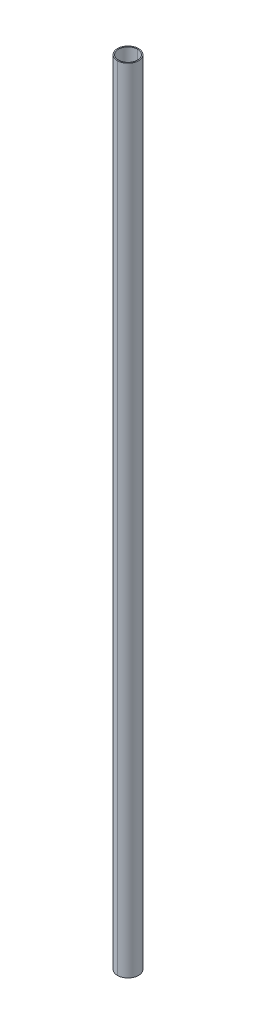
ISO-10303-21;
HEADER;
FILE_DESCRIPTION(('STEP AP214'),'2;1');
FILE_NAME('part.step','',(''),(''),'','','');
FILE_SCHEMA(('AUTOMOTIVE_DESIGN { 1 0 10303 214 1 1 1 1 }'));
ENDSEC;
DATA;
#1=APPLICATION_CONTEXT('core data for automotive mechanical design processes');
#2=APPLICATION_PROTOCOL_DEFINITION('international standard','automotive_design',2000,#1);
#3=PRODUCT_CONTEXT('',#1,'mechanical');
#4=PRODUCT('Part','Part','',(#3));
#5=PRODUCT_RELATED_PRODUCT_CATEGORY('part','',(#4));
#6=PRODUCT_DEFINITION_FORMATION('','',#4);
#7=PRODUCT_DEFINITION_CONTEXT('part definition',#1,'design');
#8=PRODUCT_DEFINITION('design','',#6,#7);
#9=PRODUCT_DEFINITION_SHAPE('','',#8);
#10=(LENGTH_UNIT() NAMED_UNIT(*) SI_UNIT(.MILLI.,.METRE.));
#11=(NAMED_UNIT(*) PLANE_ANGLE_UNIT() SI_UNIT($,.RADIAN.));
#12=(NAMED_UNIT(*) SI_UNIT($,.STERADIAN.) SOLID_ANGLE_UNIT());
#13=UNCERTAINTY_MEASURE_WITH_UNIT(LENGTH_MEASURE(1.E-05),#10,'distance_accuracy_value','');
#14=(GEOMETRIC_REPRESENTATION_CONTEXT(3) GLOBAL_UNCERTAINTY_ASSIGNED_CONTEXT((#13)) GLOBAL_UNIT_ASSIGNED_CONTEXT((#10,
#11,#12)) REPRESENTATION_CONTEXT('',''));
#15=CARTESIAN_POINT('',(0.,0.,0.));
#16=DIRECTION('',(0.,0.,1.));
#17=DIRECTION('',(1.,0.,0.));
#18=AXIS2_PLACEMENT_3D('',#15,#16,#17);
#19=CARTESIAN_POINT('',(0.,1500.,0.));
#20=DIRECTION('',(0.,-1.,0.));
#21=DIRECTION('',(0.,0.,-1.));
#22=AXIS2_PLACEMENT_3D('',#19,#20,#21);
#23=CYLINDRICAL_SURFACE('',#22,18.);
#24=DIRECTION('',(0.,-1.,0.));
#25=VECTOR('',#24,1.);
#26=CARTESIAN_POINT('',(0.,1500.,18.));
#27=LINE('',#26,#25);
#28=CARTESIAN_POINT('',(0.,1500.,18.));
#29=VERTEX_POINT('',#28);
#30=CARTESIAN_POINT('',(0.,0.,18.));
#31=VERTEX_POINT('',#30);
#32=EDGE_CURVE('E143',#29,#31,#27,.T.);
#33=ORIENTED_EDGE('',*,*,#32,.F.);
#34=CARTESIAN_POINT('',(0.,1500.,0.));
#35=DIRECTION('',(0.,1.,0.));
#36=DIRECTION('',(0.,0.,1.));
#37=AXIS2_PLACEMENT_3D('',#34,#35,#36);
#38=CIRCLE('',#37,18.);
#39=CARTESIAN_POINT('',(0.,1500.,-18.));
#40=VERTEX_POINT('',#39);
#41=EDGE_CURVE('E75',#29,#40,#38,.T.);
#42=ORIENTED_EDGE('',*,*,#41,.T.);
#43=DIRECTION('',(0.,-1.,0.));
#44=VECTOR('',#43,1.);
#45=CARTESIAN_POINT('',(0.,1500.,-18.));
#46=LINE('',#45,#44);
#47=CARTESIAN_POINT('',(0.,0.,-18.));
#48=VERTEX_POINT('',#47);
#49=EDGE_CURVE('E88',#40,#48,#46,.T.);
#50=ORIENTED_EDGE('',*,*,#49,.T.);
#51=CARTESIAN_POINT('',(0.,0.,0.));
#52=DIRECTION('',(0.,1.,0.));
#53=DIRECTION('',(0.,0.,1.));
#54=AXIS2_PLACEMENT_3D('',#51,#52,#53);
#55=CIRCLE('',#54,18.);
#56=EDGE_CURVE('E10',#31,#48,#55,.T.);
#57=ORIENTED_EDGE('',*,*,#56,.F.);
#58=EDGE_LOOP('',(#33,#42,#50,#57));
#59=FACE_BOUND('',#58,.T.);
#60=ADVANCED_FACE('F16',(#59),#23,.F.);
#61=CARTESIAN_POINT('',(0.,1500.,0.));
#62=DIRECTION('',(0.,-1.,0.));
#63=DIRECTION('',(0.,0.,-1.));
#64=AXIS2_PLACEMENT_3D('',#61,#62,#63);
#65=CYLINDRICAL_SURFACE('',#64,20.);
#66=DIRECTION('',(0.,-1.,0.));
#67=VECTOR('',#66,1.);
#68=CARTESIAN_POINT('',(0.,1500.,20.));
#69=LINE('',#68,#67);
#70=CARTESIAN_POINT('',(0.,1500.,20.));
#71=VERTEX_POINT('',#70);
#72=CARTESIAN_POINT('',(0.,0.,20.));
#73=VERTEX_POINT('',#72);
#74=EDGE_CURVE('E79',#71,#73,#69,.T.);
#75=ORIENTED_EDGE('',*,*,#74,.F.);
#76=CARTESIAN_POINT('',(0.,1500.,0.));
#77=DIRECTION('',(0.,1.,0.));
#78=DIRECTION('',(0.,0.,1.));
#79=AXIS2_PLACEMENT_3D('',#76,#77,#78);
#80=CIRCLE('',#79,20.);
#81=CARTESIAN_POINT('',(0.,1500.,-20.));
#82=VERTEX_POINT('',#81);
#83=EDGE_CURVE('E69',#82,#71,#80,.T.);
#84=ORIENTED_EDGE('',*,*,#83,.F.);
#85=DIRECTION('',(0.,-1.,0.));
#86=VECTOR('',#85,1.);
#87=CARTESIAN_POINT('',(0.,1500.,-20.));
#88=LINE('',#87,#86);
#89=CARTESIAN_POINT('',(0.,0.,-20.));
#90=VERTEX_POINT('',#89);
#91=EDGE_CURVE('E76',#82,#90,#88,.T.);
#92=ORIENTED_EDGE('',*,*,#91,.T.);
#93=CARTESIAN_POINT('',(0.,0.,0.));
#94=DIRECTION('',(0.,1.,0.));
#95=DIRECTION('',(0.,0.,1.));
#96=AXIS2_PLACEMENT_3D('',#93,#94,#95);
#97=CIRCLE('',#96,20.);
#98=EDGE_CURVE('E24',#90,#73,#97,.T.);
#99=ORIENTED_EDGE('',*,*,#98,.T.);
#100=EDGE_LOOP('',(#75,#84,#92,#99));
#101=FACE_BOUND('',#100,.T.);
#102=ADVANCED_FACE('F80',(#101),#65,.T.);
#103=CARTESIAN_POINT('',(0.,0.,0.));
#104=DIRECTION('',(0.,1.,0.));
#105=DIRECTION('',(1.,0.,0.));
#106=AXIS2_PLACEMENT_3D('',#103,#104,#105);
#107=PLANE('',#106);
#108=CARTESIAN_POINT('',(0.,0.,0.));
#109=DIRECTION('',(0.,1.,0.));
#110=DIRECTION('',(0.,0.,1.));
#111=AXIS2_PLACEMENT_3D('',#108,#109,#110);
#112=CIRCLE('',#111,18.);
#113=EDGE_CURVE('E94',#48,#31,#112,.T.);
#114=ORIENTED_EDGE('',*,*,#113,.T.);
#115=ORIENTED_EDGE('',*,*,#56,.T.);
#116=EDGE_LOOP('',(#114,#115));
#117=FACE_BOUND('',#116,.T.);
#118=ORIENTED_EDGE('',*,*,#98,.F.);
#119=CARTESIAN_POINT('',(0.,0.,0.));
#120=DIRECTION('',(0.,1.,0.));
#121=DIRECTION('',(0.,0.,1.));
#122=AXIS2_PLACEMENT_3D('',#119,#120,#121);
#123=CIRCLE('',#122,20.);
#124=EDGE_CURVE('E84',#73,#90,#123,.T.);
#125=ORIENTED_EDGE('',*,*,#124,.F.);
#126=EDGE_LOOP('',(#118,#125));
#127=FACE_BOUND('',#126,.T.);
#128=ADVANCED_FACE('F210',(#117,#127),#107,.F.);
#129=CARTESIAN_POINT('',(0.,1500.,0.));
#130=DIRECTION('',(0.,1.,0.));
#131=DIRECTION('',(1.,0.,0.));
#132=AXIS2_PLACEMENT_3D('',#129,#130,#131);
#133=PLANE('',#132);
#134=CARTESIAN_POINT('',(0.,1500.,0.));
#135=DIRECTION('',(0.,1.,0.));
#136=DIRECTION('',(0.,0.,1.));
#137=AXIS2_PLACEMENT_3D('',#134,#135,#136);
#138=CIRCLE('',#137,18.);
#139=EDGE_CURVE('E152',#40,#29,#138,.T.);
#140=ORIENTED_EDGE('',*,*,#139,.F.);
#141=ORIENTED_EDGE('',*,*,#41,.F.);
#142=EDGE_LOOP('',(#140,#141));
#143=FACE_BOUND('',#142,.T.);
#144=ORIENTED_EDGE('',*,*,#83,.T.);
#145=CARTESIAN_POINT('',(0.,1500.,0.));
#146=DIRECTION('',(0.,1.,0.));
#147=DIRECTION('',(0.,0.,1.));
#148=AXIS2_PLACEMENT_3D('',#145,#146,#147);
#149=CIRCLE('',#148,20.);
#150=EDGE_CURVE('E72',#71,#82,#149,.T.);
#151=ORIENTED_EDGE('',*,*,#150,.T.);
#152=EDGE_LOOP('',(#144,#151));
#153=FACE_BOUND('',#152,.T.);
#154=ADVANCED_FACE('F70',(#143,#153),#133,.T.);
#155=CARTESIAN_POINT('',(0.,1500.,0.));
#156=DIRECTION('',(0.,-1.,0.));
#157=DIRECTION('',(0.,0.,-1.));
#158=AXIS2_PLACEMENT_3D('',#155,#156,#157);
#159=CYLINDRICAL_SURFACE('',#158,20.);
#160=ORIENTED_EDGE('',*,*,#150,.F.);
#161=ORIENTED_EDGE('',*,*,#74,.T.);
#162=ORIENTED_EDGE('',*,*,#124,.T.);
#163=ORIENTED_EDGE('',*,*,#91,.F.);
#164=EDGE_LOOP('',(#160,#161,#162,#163));
#165=FACE_BOUND('',#164,.T.);
#166=ADVANCED_FACE('F86',(#165),#159,.T.);
#167=CARTESIAN_POINT('',(0.,1500.,0.));
#168=DIRECTION('',(0.,-1.,0.));
#169=DIRECTION('',(0.,0.,-1.));
#170=AXIS2_PLACEMENT_3D('',#167,#168,#169);
#171=CYLINDRICAL_SURFACE('',#170,18.);
#172=ORIENTED_EDGE('',*,*,#139,.T.);
#173=ORIENTED_EDGE('',*,*,#32,.T.);
#174=ORIENTED_EDGE('',*,*,#113,.F.);
#175=ORIENTED_EDGE('',*,*,#49,.F.);
#176=EDGE_LOOP('',(#172,#173,#174,#175));
#177=FACE_BOUND('',#176,.T.);
#178=ADVANCED_FACE('F195',(#177),#171,.F.);
#179=CLOSED_SHELL('',(#60,#102,#128,#154,#166,#178));
#180=MANIFOLD_SOLID_BREP('B1',#179);
#181=ADVANCED_BREP_SHAPE_REPRESENTATION('',(#18,#180),#14);
#182=SHAPE_DEFINITION_REPRESENTATION(#9,#181);
ENDSEC;
END-ISO-10303-21;
